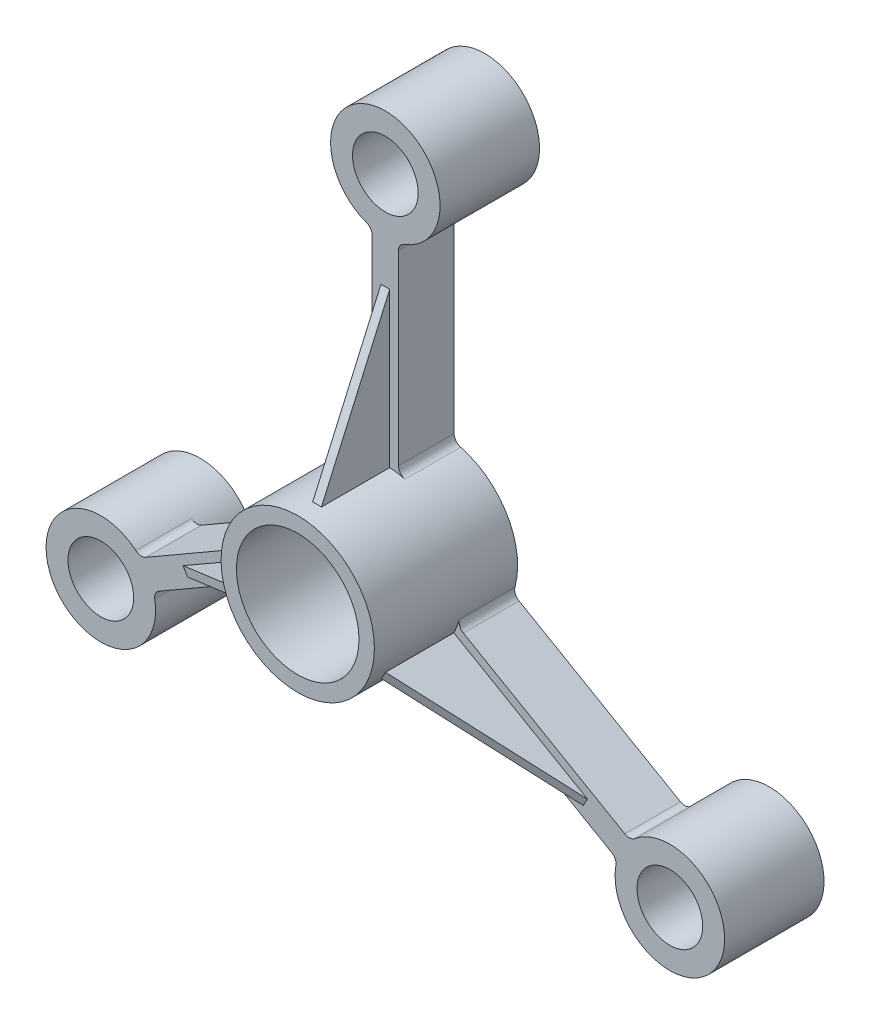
from build123d import *
from build123d.topology import SkipClean

# Parameters (mm, degrees)
EXTRUSION_DEPTH       = 12.7
EXTRUIR1_START        = 10
CROQUIS1_R            = 12.5
EXTRUIR1_DEPTH        = 10
CROQUIS2_R            = 17.5
EXTRUIR2_DEPTH        = 20
CROQUIS3_R            = 13.987467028
CORTAR_EXTRUIR1_DEPTH = 20
CROQUIS4_R            = 8.332923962
CORTAR_EXTRUIR2_DEPTH = 120.039227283
CROQUIS5_R            = 7.5
CORTAR_EXTRUIR3_DEPTH = 120.039227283
NERVIO1_REACH         = 123.344
CROQUIS6_WALL_W       = 295.488139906
CROQUIS6_WALL_H       = 2
MATRIZC1_COUNT        = 3


with BuildPart() as part:
    # Sketch2 → extrusion (new body)
    with BuildSketch(Plane.XY):
        with BuildLine():
            Line((-3, 61.389342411), (-3, 18.848076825))
            ThreePointArc((-3, 18.848076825), (-3.414812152, 17.628577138), (-4.487179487, 16.91494074))
            ThreePointArc((-4.487179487, 16.91494074), (-15.155444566, 8.75), (-16.892358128, -4.571458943))
            ThreePointArc((-16.892358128, -4.571458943), (-16.97420171, -5.856974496), (-17.822913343, -6.825962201))
            Line((-17.822913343, -6.825962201), (-54.66473005, -28.096594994))
            ThreePointArc((-54.66473005, -28.096594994), (-55.836063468, -28.357191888), (-56.945719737, -27.900469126))
            ThreePointArc((-56.945719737, -27.900469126), (-75.777222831, -43.75), (-52.63537491, -35.366205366))
            ThreePointArc((-52.63537491, -35.366205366), (-52.476080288, -34.176853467), (-51.66473005, -33.292747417))
            Line((-51.66473005, -33.292747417), (-14.822913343, -12.022114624))
            ThreePointArc((-14.822913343, -12.022114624), (-13.559389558, -11.771602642), (-12.405178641, -12.343481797))
            ThreePointArc((-12.405178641, -12.343481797), (0, -17.5), (12.405178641, -12.343481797))
            ThreePointArc((12.405178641, -12.343481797), (13.559389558, -11.771602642), (14.822913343, -12.022114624))
            Line((14.822913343, -12.022114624), (51.66473005, -33.292747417))
            ThreePointArc((51.66473005, -33.292747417), (52.476080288, -34.176853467), (52.63537491, -35.366205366))
            ThreePointArc((52.63537491, -35.366205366), (75.777222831, -43.75), (56.945719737, -27.900469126))
            ThreePointArc((56.945719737, -27.900469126), (55.836063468, -28.357191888), (54.66473005, -28.096594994))
            Line((54.66473005, -28.096594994), (17.822913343, -6.825962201))
            ThreePointArc((17.822913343, -6.825962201), (16.97420171, -5.856974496), (16.892358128, -4.571458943))
            ThreePointArc((16.892358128, -4.571458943), (15.155444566, 8.75), (4.487179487, 16.91494074))
            ThreePointArc((4.487179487, 16.91494074), (3.414812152, 17.628577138), (3, 18.848076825))
            Line((3, 18.848076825), (3, 61.389342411))
            ThreePointArc((3, 61.389342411), (3.359983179, 62.534045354), (4.310344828, 63.266674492))
            ThreePointArc((4.310344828, 63.266674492), (0, 87.5), (-4.310344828, 63.266674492))
            ThreePointArc((-4.310344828, 63.266674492), (-3.359983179, 62.534045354), (-3, 61.389342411))
        make_face()
    extrude(amount=EXTRUSION_DEPTH)

    # Croquis1 → Extruir1 (add)
    with SkipClean():  # the faces are left unmerged after this step: merging them gives an invalid solid
        with BuildSketch(Plane(origin=(0, 0, 0), x_dir=(-1, 0, 0), z_dir=(0, 0, -1)).offset(EXTRUIR1_START)):
            with Locations((0, 75)):
                Circle(CROQUIS1_R)
            with Locations((-64.951905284, -37.5)):
                Circle(CROQUIS1_R)
            with Locations((64.951905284, -37.5)):
                Circle(CROQUIS1_R)
        extrude(amount=-EXTRUIR1_DEPTH)

    # Croquis2 → Extruir2 (add)
    with SkipClean():  # the faces are left unmerged after this step: merging them gives an invalid solid
        with BuildSketch(Plane.XY.offset(12.7)):
            with Locations(Location((0, 0, 0), (0, 0, 195.142834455))):
                Circle(CROQUIS2_R)
        extrude(amount=EXTRUIR2_DEPTH)

    # Croquis3 → Cortar-Extruir1 (cut)
    with SkipClean():  # the faces are left unmerged after this step: merging them gives an invalid solid
        with BuildSketch(Plane.XY.offset(32.7)):
            Circle(CROQUIS3_R)
        extrude(amount=-CORTAR_EXTRUIR1_DEPTH, mode=Mode.SUBTRACT)

    # Croquis4 → Cortar-Extruir2 (cut, through all)
    with SkipClean():  # the faces are left unmerged after this step: merging them gives an invalid solid
        with BuildSketch(Plane.XY.offset(12.7)):
            Circle(CROQUIS4_R)
        extrude(amount=-CORTAR_EXTRUIR2_DEPTH, mode=Mode.SUBTRACT)

    # Croquis5 → Cortar-Extruir3 (cut, through all)
    with SkipClean():  # the faces are left unmerged after this step: merging them gives an invalid solid
        with BuildSketch(Plane.XY.offset(12.7)):
            with Locations((0, 75)):
                Circle(CROQUIS5_R)
            with Locations((-64.951905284, -37.5)):
                Circle(CROQUIS5_R)
            with Locations((64.951905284, -37.5)):
                Circle(CROQUIS5_R)
        extrude(amount=-CORTAR_EXTRUIR3_DEPTH, mode=Mode.SUBTRACT)

    # Croquis6 wall → Nervio1 (add, up to next)
    with BuildSketch(Plane(origin=(0, 35.576402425, 20.28437297), x_dir=(0, -0.914535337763, 0.404506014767), z_dir=(0, -0.404506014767, -0.914535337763)), mode=Mode.PRIVATE) as nervio1_sk1:
        Rectangle(CROQUIS6_WALL_W, CROQUIS6_WALL_H)
    nervio1_tool1 = extrude(nervio1_sk1.sketch, amount=NERVIO1_REACH, mode=Mode.PRIVATE) - part.part
    nervio1 = nervio1_tool1.solids().sort_by_distance((0, 35.576402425, 20.28437297))[0]
    add(nervio1)

    # MatrizC1: Nervio1 ×3 about axis
    with SkipClean():  # the faces are left unmerged after this step: merging them gives an invalid solid
        matrizc1_axis = Axis((0, 0, 0), (0, 0, 1))
        for i in range(1, MATRIZC1_COUNT):
            add(nervio1.rotate(matrizc1_axis, i * 360 / MATRIZC1_COUNT))


solid = part.part
